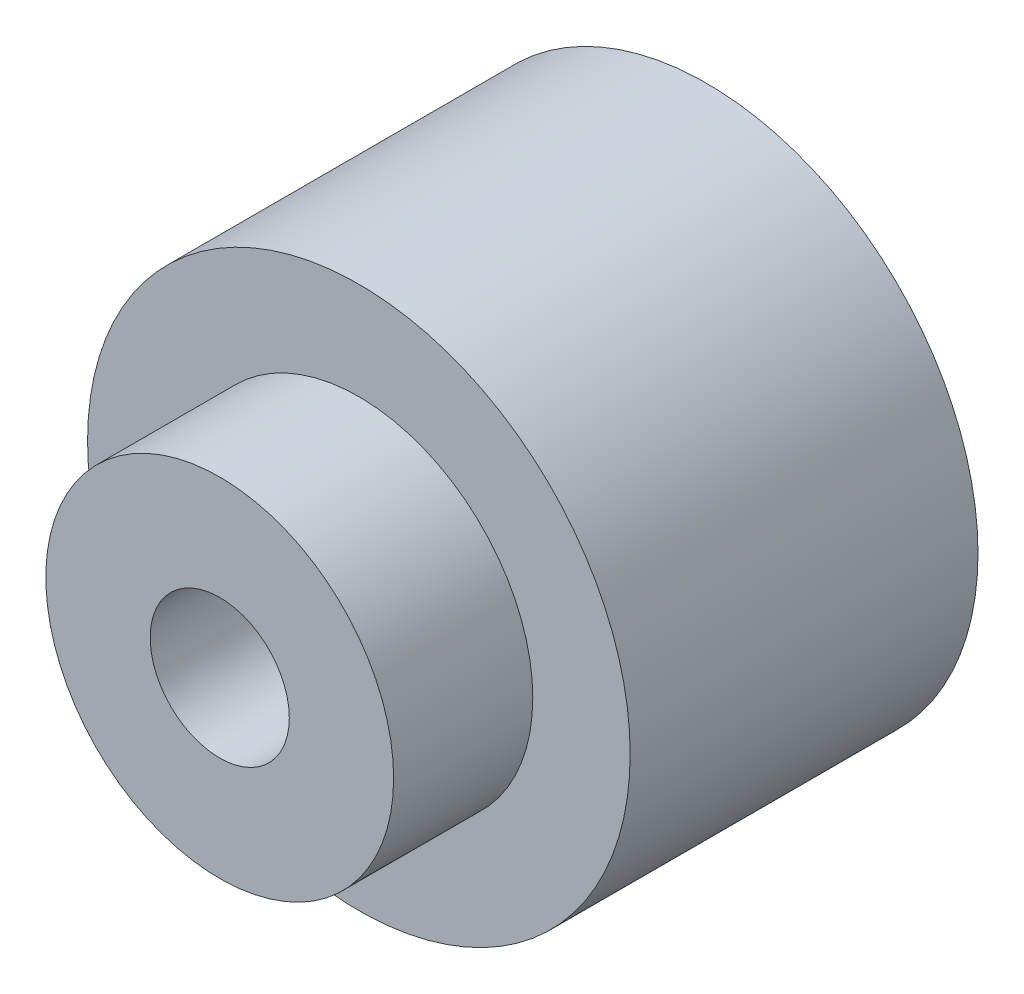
from build123d import *

# Parameters (mm, degrees)
SCHIZZO1_R                   = 39
ESTRUSIONE_ESTRUSIONE1_DEPTH = 50
SCHIZZO2_R                   = 25
ESTRUSIONE_ESTRUSIONE2_DEPTH = 20
SCHIZZO3_R                   = 10
TAGLIO_ESTRUSIONE1_DEPTH     = 90.117899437


with BuildPart() as part:
    # Schizzo1 → Estrusione-Estrusione1 (new body)
    with BuildSketch(Plane.XY):
        Circle(SCHIZZO1_R)
    extrude(amount=ESTRUSIONE_ESTRUSIONE1_DEPTH)

    # Schizzo2 → Estrusione-Estrusione2 (add)
    with BuildSketch(Plane.XY.offset(50)):
        Circle(SCHIZZO2_R)
    extrude(amount=ESTRUSIONE_ESTRUSIONE2_DEPTH)

    # Schizzo3 → Taglio-Estrusione1 (cut, through all)
    with BuildSketch(Plane.XY.offset(70)):
        Circle(SCHIZZO3_R)
    extrude(amount=-TAGLIO_ESTRUSIONE1_DEPTH, mode=Mode.SUBTRACT)


solid = part.part
